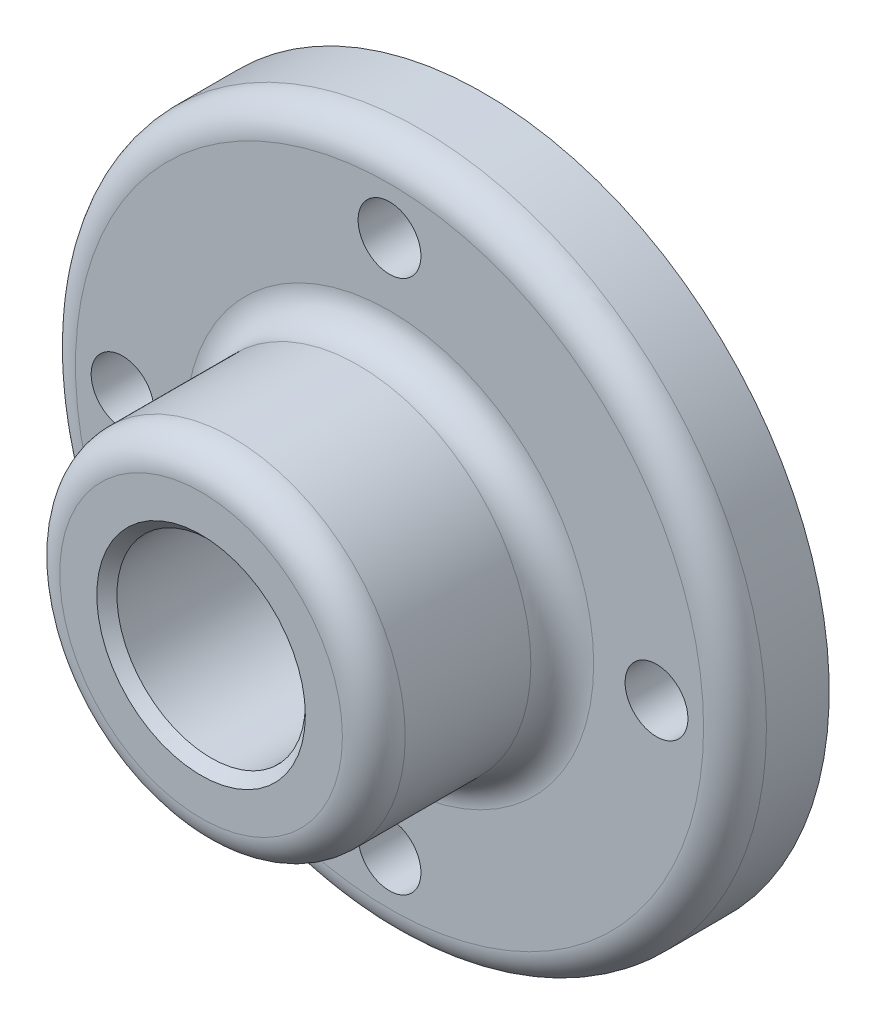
ISO-10303-21;
HEADER;
FILE_DESCRIPTION(('STEP AP214'),'2;1');
FILE_NAME('part.step','',(''),(''),'','','');
FILE_SCHEMA(('AUTOMOTIVE_DESIGN { 1 0 10303 214 1 1 1 1 }'));
ENDSEC;
DATA;
#1=APPLICATION_CONTEXT('core data for automotive mechanical design processes');
#2=APPLICATION_PROTOCOL_DEFINITION('international standard','automotive_design',2000,#1);
#3=PRODUCT_CONTEXT('',#1,'mechanical');
#4=PRODUCT('Part','Part','',(#3));
#5=PRODUCT_RELATED_PRODUCT_CATEGORY('part','',(#4));
#6=PRODUCT_DEFINITION_FORMATION('','',#4);
#7=PRODUCT_DEFINITION_CONTEXT('part definition',#1,'design');
#8=PRODUCT_DEFINITION('design','',#6,#7);
#9=PRODUCT_DEFINITION_SHAPE('','',#8);
#10=(LENGTH_UNIT() NAMED_UNIT(*) SI_UNIT(.MILLI.,.METRE.));
#11=(NAMED_UNIT(*) PLANE_ANGLE_UNIT() SI_UNIT($,.RADIAN.));
#12=(NAMED_UNIT(*) SI_UNIT($,.STERADIAN.) SOLID_ANGLE_UNIT());
#13=UNCERTAINTY_MEASURE_WITH_UNIT(LENGTH_MEASURE(1.E-05),#10,'distance_accuracy_value','');
#14=(GEOMETRIC_REPRESENTATION_CONTEXT(3) GLOBAL_UNCERTAINTY_ASSIGNED_CONTEXT((#13)) GLOBAL_UNIT_ASSIGNED_CONTEXT((#10,
#11,#12)) REPRESENTATION_CONTEXT('',''));
#15=CARTESIAN_POINT('',(0.,0.,0.));
#16=DIRECTION('',(0.,0.,1.));
#17=DIRECTION('',(1.,0.,0.));
#18=AXIS2_PLACEMENT_3D('',#15,#16,#17);
#19=CARTESIAN_POINT('',(0.,0.,19.05));
#20=DIRECTION('',(0.,0.,-1.));
#21=DIRECTION('',(-1.,0.,0.));
#22=AXIS2_PLACEMENT_3D('',#19,#20,#21);
#23=CYLINDRICAL_SURFACE('',#22,69.85);
#24=CARTESIAN_POINT('',(0.,0.,12.7));
#25=DIRECTION('',(0.,0.,1.));
#26=DIRECTION('',(1.,0.,0.));
#27=AXIS2_PLACEMENT_3D('',#24,#25,#26);
#28=CIRCLE('',#27,69.85);
#29=CARTESIAN_POINT('',(-69.85,0.,12.7));
#30=VERTEX_POINT('',#29);
#31=EDGE_CURVE('E40',#30,#30,#28,.F.);
#32=CARTESIAN_POINT('',(0.,0.,0.));
#33=DIRECTION('',(0.,0.,1.));
#34=DIRECTION('',(1.,0.,0.));
#35=AXIS2_PLACEMENT_3D('',#32,#33,#34);
#36=CIRCLE('',#35,69.85);
#37=CARTESIAN_POINT('',(-69.85,0.,0.));
#38=VERTEX_POINT('',#37);
#39=EDGE_CURVE('E61',#38,#38,#36,.T.);
#40=CARTESIAN_POINT('',(-69.85,0.,12.7));
#41=CARTESIAN_POINT('',(-69.85,0.,12.5677083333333));
#42=CARTESIAN_POINT('',(-69.85,0.,12.4354166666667));
#43=CARTESIAN_POINT('',(-69.85,0.,12.1708333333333));
#44=CARTESIAN_POINT('',(-69.85,0.,12.0385416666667));
#45=CARTESIAN_POINT('',(-69.85,0.,11.7739583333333));
#46=CARTESIAN_POINT('',(-69.85,0.,11.6416666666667));
#47=CARTESIAN_POINT('',(-69.85,0.,11.3770833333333));
#48=CARTESIAN_POINT('',(-69.85,0.,11.2447916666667));
#49=CARTESIAN_POINT('',(-69.85,0.,10.9802083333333));
#50=CARTESIAN_POINT('',(-69.85,0.,10.8479166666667));
#51=CARTESIAN_POINT('',(-69.85,0.,10.5833333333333));
#52=CARTESIAN_POINT('',(-69.85,0.,10.4510416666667));
#53=CARTESIAN_POINT('',(-69.85,0.,10.1864583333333));
#54=CARTESIAN_POINT('',(-69.85,0.,10.0541666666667));
#55=CARTESIAN_POINT('',(-69.85,0.,9.78958333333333));
#56=CARTESIAN_POINT('',(-69.85,0.,9.65729166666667));
#57=CARTESIAN_POINT('',(-69.85,0.,9.39270833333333));
#58=CARTESIAN_POINT('',(-69.85,0.,9.26041666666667));
#59=CARTESIAN_POINT('',(-69.85,0.,8.99583333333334));
#60=CARTESIAN_POINT('',(-69.85,0.,8.86354166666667));
#61=CARTESIAN_POINT('',(-69.85,0.,8.59895833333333));
#62=CARTESIAN_POINT('',(-69.85,0.,8.46666666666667));
#63=CARTESIAN_POINT('',(-69.85,0.,8.20208333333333));
#64=CARTESIAN_POINT('',(-69.85,0.,8.06979166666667));
#65=CARTESIAN_POINT('',(-69.85,0.,7.80520833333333));
#66=CARTESIAN_POINT('',(-69.85,0.,7.67291666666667));
#67=CARTESIAN_POINT('',(-69.85,0.,7.40833333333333));
#68=CARTESIAN_POINT('',(-69.85,0.,7.27604166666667));
#69=CARTESIAN_POINT('',(-69.85,0.,7.01145833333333));
#70=CARTESIAN_POINT('',(-69.85,0.,6.87916666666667));
#71=CARTESIAN_POINT('',(-69.85,0.,6.61458333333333));
#72=CARTESIAN_POINT('',(-69.85,0.,6.48229166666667));
#73=CARTESIAN_POINT('',(-69.85,0.,6.21770833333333));
#74=CARTESIAN_POINT('',(-69.85,0.,6.08541666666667));
#75=CARTESIAN_POINT('',(-69.85,0.,5.82083333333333));
#76=CARTESIAN_POINT('',(-69.85,0.,5.68854166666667));
#77=CARTESIAN_POINT('',(-69.85,0.,5.42395833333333));
#78=CARTESIAN_POINT('',(-69.85,0.,5.29166666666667));
#79=CARTESIAN_POINT('',(-69.85,0.,5.02708333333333));
#80=CARTESIAN_POINT('',(-69.85,0.,4.89479166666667));
#81=CARTESIAN_POINT('',(-69.85,0.,4.63020833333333));
#82=CARTESIAN_POINT('',(-69.85,0.,4.49791666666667));
#83=CARTESIAN_POINT('',(-69.85,0.,4.23333333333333));
#84=CARTESIAN_POINT('',(-69.85,0.,4.10104166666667));
#85=CARTESIAN_POINT('',(-69.85,0.,3.83645833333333));
#86=CARTESIAN_POINT('',(-69.85,0.,3.70416666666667));
#87=CARTESIAN_POINT('',(-69.85,0.,3.43958333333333));
#88=CARTESIAN_POINT('',(-69.85,0.,3.30729166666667));
#89=CARTESIAN_POINT('',(-69.85,0.,3.04270833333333));
#90=CARTESIAN_POINT('',(-69.85,0.,2.91041666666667));
#91=CARTESIAN_POINT('',(-69.85,0.,2.64583333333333));
#92=CARTESIAN_POINT('',(-69.85,0.,2.51354166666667));
#93=CARTESIAN_POINT('',(-69.85,0.,2.24895833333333));
#94=CARTESIAN_POINT('',(-69.85,0.,2.11666666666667));
#95=CARTESIAN_POINT('',(-69.85,0.,1.85208333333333));
#96=CARTESIAN_POINT('',(-69.85,0.,1.71979166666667));
#97=CARTESIAN_POINT('',(-69.85,0.,1.45520833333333));
#98=CARTESIAN_POINT('',(-69.85,0.,1.32291666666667));
#99=CARTESIAN_POINT('',(-69.85,0.,1.05833333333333));
#100=CARTESIAN_POINT('',(-69.85,0.,0.926041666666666));
#101=CARTESIAN_POINT('',(-69.85,0.,0.661458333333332));
#102=CARTESIAN_POINT('',(-69.85,0.,0.529166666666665));
#103=CARTESIAN_POINT('',(-69.85,0.,0.264583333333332));
#104=CARTESIAN_POINT('',(-69.85,0.,0.132291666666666));
#105=CARTESIAN_POINT('',(-69.85,0.,0.));
#106=B_SPLINE_CURVE_WITH_KNOTS('',3,(#40,#41,#42,#43,#44,#45,#46,#47,#48,#49,#50,#51,#52,#53,
#54,#55,#56,#57,#58,#59,#60,#61,#62,#63,#64,#65,#66,#67,#68,#69,#70,#71,#72,#73,#74,#75,#76,#77,
#78,#79,#80,#81,#82,#83,#84,#85,#86,#87,#88,#89,#90,#91,#92,#93,#94,#95,#96,#97,#98,#99,#100,
#101,#102,#103,#104,#105),.UNSPECIFIED.,.F.,.F.,(4,2,2,2,2,2,2,2,2,2,2,2,2,2,2,2,2,2,2,2,2,2,2,
2,2,2,2,2,2,2,2,2,4),(0.,0.396874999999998,0.793749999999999,1.190625,1.5875,1.984375,2.38125,
2.778125,3.175,3.571875,3.96875,4.365625,4.7625,5.159375,5.55625,5.953125,6.35,6.746875,7.14375,
7.540625,7.9375,8.334375,8.73125,9.128125,9.525,9.921875,10.31875,10.715625,11.1125,11.509375,
11.90625,12.303125,12.7),.UNSPECIFIED.);
#107=EDGE_CURVE('BSEAM29',#30,#38,#106,.T.);
#108=ORIENTED_EDGE('',*,*,#31,.T.);
#109=ORIENTED_EDGE('',*,*,#39,.T.);
#110=ORIENTED_EDGE('',*,*,#107,.T.);
#111=ORIENTED_EDGE('',*,*,#107,.F.);
#112=EDGE_LOOP('',(#108,#110,#109,#111));
#113=FACE_BOUND('',#112,.T.);
#114=ADVANCED_FACE('F29',(#113),#23,.T.);
#115=CARTESIAN_POINT('',(0.,0.,19.05));
#116=DIRECTION('',(0.,0.,1.));
#117=DIRECTION('',(1.,0.,0.));
#118=AXIS2_PLACEMENT_3D('',#115,#116,#117);
#119=PLANE('',#118);
#120=CARTESIAN_POINT('',(0.,0.,19.05));
#121=DIRECTION('',(0.,0.,1.));
#122=DIRECTION('',(1.,0.,0.));
#123=AXIS2_PLACEMENT_3D('',#120,#121,#122);
#124=CIRCLE('',#123,41.275);
#125=CARTESIAN_POINT('',(41.275,0.,19.05));
#126=VERTEX_POINT('',#125);
#127=EDGE_CURVE('E44',#126,#126,#124,.F.);
#128=ORIENTED_EDGE('',*,*,#127,.T.);
#129=EDGE_LOOP('',(#128));
#130=FACE_BOUND('',#129,.T.);
#131=CARTESIAN_POINT('',(0.,0.,19.05));
#132=DIRECTION('',(0.,0.,1.));
#133=DIRECTION('',(1.,0.,0.));
#134=AXIS2_PLACEMENT_3D('',#131,#132,#133);
#135=CIRCLE('',#134,63.5);
#136=CARTESIAN_POINT('',(63.5,0.,19.05));
#137=VERTEX_POINT('',#136);
#138=EDGE_CURVE('E49',#137,#137,#135,.T.);
#139=ORIENTED_EDGE('',*,*,#138,.T.);
#140=EDGE_LOOP('',(#139));
#141=FACE_BOUND('',#140,.T.);
#142=CARTESIAN_POINT('',(53.975,5.65358443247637E-13,19.05));
#143=DIRECTION('',(0.,0.,1.));
#144=DIRECTION('',(0.,-1.,0.));
#145=AXIS2_PLACEMENT_3D('',#142,#143,#144);
#146=CIRCLE('',#145,6.35);
#147=CARTESIAN_POINT('',(53.9750000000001,-6.34999999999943,19.05));
#148=VERTEX_POINT('',#147);
#149=EDGE_CURVE('E85',#148,#148,#146,.T.);
#150=ORIENTED_EDGE('',*,*,#149,.F.);
#151=EDGE_LOOP('',(#150));
#152=FACE_BOUND('',#151,.T.);
#153=CARTESIAN_POINT('',(3.76905628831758E-13,-53.975,19.05));
#154=DIRECTION('',(0.,0.,1.));
#155=DIRECTION('',(-1.,0.,0.));
#156=AXIS2_PLACEMENT_3D('',#153,#154,#155);
#157=CIRCLE('',#156,6.35);
#158=CARTESIAN_POINT('',(-6.34999999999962,-53.975,19.05));
#159=VERTEX_POINT('',#158);
#160=EDGE_CURVE('E79',#159,#159,#157,.T.);
#161=ORIENTED_EDGE('',*,*,#160,.F.);
#162=EDGE_LOOP('',(#161));
#163=FACE_BOUND('',#162,.T.);
#164=CARTESIAN_POINT('',(-53.975,-1.88452814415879E-13,19.05));
#165=DIRECTION('',(0.,0.,1.));
#166=DIRECTION('',(0.,1.,0.));
#167=AXIS2_PLACEMENT_3D('',#164,#165,#166);
#168=CIRCLE('',#167,6.35);
#169=CARTESIAN_POINT('',(-53.975,6.34999999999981,19.05));
#170=VERTEX_POINT('',#169);
#171=EDGE_CURVE('E71',#170,#170,#168,.T.);
#172=ORIENTED_EDGE('',*,*,#171,.F.);
#173=EDGE_LOOP('',(#172));
#174=FACE_BOUND('',#173,.T.);
#175=CARTESIAN_POINT('',(0.,53.975,19.05));
#176=DIRECTION('',(0.,0.,1.));
#177=DIRECTION('',(1.,0.,0.));
#178=AXIS2_PLACEMENT_3D('',#175,#176,#177);
#179=CIRCLE('',#178,6.35);
#180=CARTESIAN_POINT('',(6.35,53.975,19.05));
#181=VERTEX_POINT('',#180);
#182=EDGE_CURVE('E68',#181,#181,#179,.T.);
#183=ORIENTED_EDGE('',*,*,#182,.F.);
#184=EDGE_LOOP('',(#183));
#185=FACE_BOUND('',#184,.T.);
#186=ADVANCED_FACE('F103',(#130,#141,#152,#163,#174,#185),#119,.T.);
#187=CARTESIAN_POINT('',(0.,0.,0.));
#188=DIRECTION('',(0.,0.,1.));
#189=DIRECTION('',(1.,0.,0.));
#190=AXIS2_PLACEMENT_3D('',#187,#188,#189);
#191=PLANE('',#190);
#192=CARTESIAN_POINT('',(53.975,5.65358443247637E-13,0.));
#193=DIRECTION('',(0.,0.,1.));
#194=DIRECTION('',(0.,-1.,0.));
#195=AXIS2_PLACEMENT_3D('',#192,#193,#194);
#196=CIRCLE('',#195,6.35);
#197=CARTESIAN_POINT('',(53.9750000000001,-6.34999999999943,0.));
#198=VERTEX_POINT('',#197);
#199=EDGE_CURVE('E88',#198,#198,#196,.T.);
#200=ORIENTED_EDGE('',*,*,#199,.T.);
#201=EDGE_LOOP('',(#200));
#202=FACE_BOUND('',#201,.T.);
#203=CARTESIAN_POINT('',(3.76905628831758E-13,-53.975,0.));
#204=DIRECTION('',(0.,0.,1.));
#205=DIRECTION('',(-1.,0.,0.));
#206=AXIS2_PLACEMENT_3D('',#203,#204,#205);
#207=CIRCLE('',#206,6.35);
#208=CARTESIAN_POINT('',(-6.34999999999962,-53.975,0.));
#209=VERTEX_POINT('',#208);
#210=EDGE_CURVE('E82',#209,#209,#207,.T.);
#211=ORIENTED_EDGE('',*,*,#210,.T.);
#212=EDGE_LOOP('',(#211));
#213=FACE_BOUND('',#212,.T.);
#214=CARTESIAN_POINT('',(-53.975,-1.88452814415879E-13,0.));
#215=DIRECTION('',(0.,0.,1.));
#216=DIRECTION('',(0.,1.,0.));
#217=AXIS2_PLACEMENT_3D('',#214,#215,#216);
#218=CIRCLE('',#217,6.35);
#219=CARTESIAN_POINT('',(-53.975,6.34999999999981,0.));
#220=VERTEX_POINT('',#219);
#221=EDGE_CURVE('E76',#220,#220,#218,.T.);
#222=ORIENTED_EDGE('',*,*,#221,.T.);
#223=EDGE_LOOP('',(#222));
#224=FACE_BOUND('',#223,.T.);
#225=CARTESIAN_POINT('',(0.,53.975,0.));
#226=DIRECTION('',(0.,0.,1.));
#227=DIRECTION('',(1.,0.,0.));
#228=AXIS2_PLACEMENT_3D('',#225,#226,#227);
#229=CIRCLE('',#228,6.35);
#230=CARTESIAN_POINT('',(6.35,53.975,0.));
#231=VERTEX_POINT('',#230);
#232=EDGE_CURVE('E67',#231,#231,#229,.T.);
#233=ORIENTED_EDGE('',*,*,#232,.T.);
#234=EDGE_LOOP('',(#233));
#235=FACE_BOUND('',#234,.T.);
#236=CARTESIAN_POINT('',(0.,0.,0.));
#237=DIRECTION('',(0.,0.,1.));
#238=DIRECTION('',(1.,0.,0.));
#239=AXIS2_PLACEMENT_3D('',#236,#237,#238);
#240=CIRCLE('',#239,19.05);
#241=CARTESIAN_POINT('',(19.05,0.,0.));
#242=VERTEX_POINT('',#241);
#243=EDGE_CURVE('E64',#242,#242,#240,.T.);
#244=ORIENTED_EDGE('',*,*,#243,.T.);
#245=EDGE_LOOP('',(#244));
#246=FACE_BOUND('',#245,.T.);
#247=ORIENTED_EDGE('',*,*,#39,.F.);
#248=EDGE_LOOP('',(#247));
#249=FACE_BOUND('',#248,.T.);
#250=ADVANCED_FACE('F92',(#202,#213,#224,#235,#246,#249),#191,.F.);
#251=CARTESIAN_POINT('',(0.,0.,-500000.));
#252=DIRECTION('',(0.,0.,1.));
#253=DIRECTION('',(1.,0.,0.));
#254=AXIS2_PLACEMENT_3D('',#251,#252,#253);
#255=CYLINDRICAL_SURFACE('',#254,34.925);
#256=CARTESIAN_POINT('',(0.,0.,50.7999999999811));
#257=DIRECTION('',(0.,0.,1.));
#258=DIRECTION('',(1.,0.,0.));
#259=AXIS2_PLACEMENT_3D('',#256,#257,#258);
#260=CIRCLE('',#259,34.925);
#261=CARTESIAN_POINT('',(34.925,0.,50.7999999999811));
#262=VERTEX_POINT('',#261);
#263=EDGE_CURVE('E52',#262,#262,#260,.F.);
#264=CARTESIAN_POINT('',(0.,0.,25.3999999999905));
#265=DIRECTION('',(0.,0.,1.));
#266=DIRECTION('',(1.,0.,0.));
#267=AXIS2_PLACEMENT_3D('',#264,#265,#266);
#268=CIRCLE('',#267,34.925);
#269=CARTESIAN_POINT('',(34.925,0.,25.3999999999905));
#270=VERTEX_POINT('',#269);
#271=EDGE_CURVE('E55',#270,#270,#268,.T.);
#272=CARTESIAN_POINT('',(34.925,0.,50.7999999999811));
#273=CARTESIAN_POINT('',(34.925,0.,50.5354166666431));
#274=CARTESIAN_POINT('',(34.925,0.,50.2708333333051));
#275=CARTESIAN_POINT('',(34.925,0.,49.7416666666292));
#276=CARTESIAN_POINT('',(34.925,0.,49.4770833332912));
#277=CARTESIAN_POINT('',(34.925,0.,48.9479166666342));
#278=CARTESIAN_POINT('',(34.925,0.,48.6833333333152));
#279=CARTESIAN_POINT('',(34.925,0.,48.1541666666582));
#280=CARTESIAN_POINT('',(34.925,0.,47.8895833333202));
#281=CARTESIAN_POINT('',(34.925,0.,47.3604166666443));
#282=CARTESIAN_POINT('',(34.925,0.,47.0958333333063));
#283=CARTESIAN_POINT('',(34.925,0.,46.5666666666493));
#284=CARTESIAN_POINT('',(34.925,0.,46.3020833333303));
#285=CARTESIAN_POINT('',(34.925,0.,45.7729166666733));
#286=CARTESIAN_POINT('',(34.925,0.,45.5083333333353));
#287=CARTESIAN_POINT('',(34.925,0.,44.9791666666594));
#288=CARTESIAN_POINT('',(34.925,0.,44.7145833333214));
#289=CARTESIAN_POINT('',(34.925,0.,44.1854166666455));
#290=CARTESIAN_POINT('',(34.925,0.,43.9208333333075));
#291=CARTESIAN_POINT('',(34.925,0.,43.3916666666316));
#292=CARTESIAN_POINT('',(34.925,0.,43.1270833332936));
#293=CARTESIAN_POINT('',(34.925,0.,42.5979166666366));
#294=CARTESIAN_POINT('',(34.925,0.,42.3333333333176));
#295=CARTESIAN_POINT('',(34.925,0.,41.8041666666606));
#296=CARTESIAN_POINT('',(34.925,0.,41.5395833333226));
#297=CARTESIAN_POINT('',(34.925,0.,41.0104166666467));
#298=CARTESIAN_POINT('',(34.925,0.,40.7458333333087));
#299=CARTESIAN_POINT('',(34.925,0.,40.2166666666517));
#300=CARTESIAN_POINT('',(34.925,0.,39.9520833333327));
#301=CARTESIAN_POINT('',(34.925,0.,39.4229166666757));
#302=CARTESIAN_POINT('',(34.925,0.,39.1583333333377));
#303=CARTESIAN_POINT('',(34.925,0.,38.6291666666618));
#304=CARTESIAN_POINT('',(34.925,0.,38.3645833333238));
#305=CARTESIAN_POINT('',(34.925,0.,37.8354166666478));
#306=CARTESIAN_POINT('',(34.925,0.,37.5708333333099));
#307=CARTESIAN_POINT('',(34.925,0.,37.0416666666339));
#308=CARTESIAN_POINT('',(34.925,0.,36.777083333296));
#309=CARTESIAN_POINT('',(34.925,0.,36.247916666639));
#310=CARTESIAN_POINT('',(34.925,0.,35.9833333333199));
#311=CARTESIAN_POINT('',(34.925,0.,35.4541666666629));
#312=CARTESIAN_POINT('',(34.925,0.,35.189583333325));
#313=CARTESIAN_POINT('',(34.925,0.,34.660416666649));
#314=CARTESIAN_POINT('',(34.925,0.,34.3958333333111));
#315=CARTESIAN_POINT('',(34.925,0.,33.8666666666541));
#316=CARTESIAN_POINT('',(34.925,0.,33.602083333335));
#317=CARTESIAN_POINT('',(34.925,0.,33.072916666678));
#318=CARTESIAN_POINT('',(34.925,0.,32.8083333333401));
#319=CARTESIAN_POINT('',(34.925,0.,32.2791666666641));
#320=CARTESIAN_POINT('',(34.925,0.,32.0145833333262));
#321=CARTESIAN_POINT('',(34.925,0.,31.4854166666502));
#322=CARTESIAN_POINT('',(34.925,0.,31.2208333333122));
#323=CARTESIAN_POINT('',(34.925,0.,30.6916666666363));
#324=CARTESIAN_POINT('',(34.925,0.,30.4270833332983));
#325=CARTESIAN_POINT('',(34.925,0.,29.8979166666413));
#326=CARTESIAN_POINT('',(34.925,0.,29.6333333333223));
#327=CARTESIAN_POINT('',(34.925,0.,29.1041666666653));
#328=CARTESIAN_POINT('',(34.925,0.,28.8395833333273));
#329=CARTESIAN_POINT('',(34.925,0.,28.3104166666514));
#330=CARTESIAN_POINT('',(34.925,0.,28.0458333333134));
#331=CARTESIAN_POINT('',(34.925,0.,27.5166666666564));
#332=CARTESIAN_POINT('',(34.925,0.,27.2520833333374));
#333=CARTESIAN_POINT('',(34.925,0.,26.7229166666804));
#334=CARTESIAN_POINT('',(34.925,0.,26.4583333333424));
#335=CARTESIAN_POINT('',(34.925,0.,25.9291666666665));
#336=CARTESIAN_POINT('',(34.925,0.,25.6645833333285));
#337=CARTESIAN_POINT('',(34.925,0.,25.3999999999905));
#338=B_SPLINE_CURVE_WITH_KNOTS('',3,(#272,#273,#274,#275,#276,#277,#278,#279,#280,#281,#282,
#283,#284,#285,#286,#287,#288,#289,#290,#291,#292,#293,#294,#295,#296,#297,#298,#299,#300,#301,
#302,#303,#304,#305,#306,#307,#308,#309,#310,#311,#312,#313,#314,#315,#316,#317,#318,#319,#320,
#321,#322,#323,#324,#325,#326,#327,#328,#329,#330,#331,#332,#333,#334,#335,#336,#337),
.UNSPECIFIED.,.F.,.F.,(4,2,2,2,2,2,2,2,2,2,2,2,2,2,2,2,2,2,2,2,2,2,2,2,2,2,2,2,2,2,2,2,4),(0.,
0.793750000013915,1.58750000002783,2.3812499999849,3.17499999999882,3.96875000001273,
4.7624999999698,5.55624999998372,6.34999999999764,7.14375000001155,7.93750000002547,
8.73124999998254,9.52499999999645,10.3187500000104,11.1124999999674,11.9062499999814,
12.6999999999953,13.4937500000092,14.2875000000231,15.0812499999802,15.8749999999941,
16.668750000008,17.4624999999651,18.256249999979,19.0499999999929,19.8437500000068,
20.6375000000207,21.4312499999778,22.2249999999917,23.0187500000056,23.8124999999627,
24.6062499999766,25.3999999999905),.UNSPECIFIED.);
#339=EDGE_CURVE('BSEAM128',#262,#270,#338,.T.);
#340=ORIENTED_EDGE('',*,*,#263,.T.);
#341=ORIENTED_EDGE('',*,*,#271,.T.);
#342=ORIENTED_EDGE('',*,*,#339,.T.);
#343=ORIENTED_EDGE('',*,*,#339,.F.);
#344=EDGE_LOOP('',(#340,#342,#341,#343));
#345=FACE_BOUND('',#344,.T.);
#346=ADVANCED_FACE('F128',(#345),#255,.T.);
#347=CARTESIAN_POINT('',(0.,0.,57.15));
#348=DIRECTION('',(0.,0.,1.));
#349=DIRECTION('',(1.,0.,0.));
#350=AXIS2_PLACEMENT_3D('',#347,#348,#349);
#351=PLANE('',#350);
#352=CARTESIAN_POINT('',(0.,0.,57.15));
#353=DIRECTION('',(0.,0.,1.));
#354=DIRECTION('',(1.,0.,0.));
#355=AXIS2_PLACEMENT_3D('',#352,#353,#354);
#356=CIRCLE('',#355,21.082);
#357=CARTESIAN_POINT('',(21.082,0.,57.15));
#358=VERTEX_POINT('',#357);
#359=EDGE_CURVE('E10',#358,#358,#356,.F.);
#360=ORIENTED_EDGE('',*,*,#359,.T.);
#361=EDGE_LOOP('',(#360));
#362=FACE_BOUND('',#361,.T.);
#363=CARTESIAN_POINT('',(0.,0.,57.15));
#364=DIRECTION('',(0.,0.,1.));
#365=DIRECTION('',(1.,0.,0.));
#366=AXIS2_PLACEMENT_3D('',#363,#364,#365);
#367=CIRCLE('',#366,28.575);
#368=CARTESIAN_POINT('',(28.575,0.,57.15));
#369=VERTEX_POINT('',#368);
#370=EDGE_CURVE('E58',#369,#369,#367,.T.);
#371=ORIENTED_EDGE('',*,*,#370,.T.);
#372=EDGE_LOOP('',(#371));
#373=FACE_BOUND('',#372,.T.);
#374=ADVANCED_FACE('F126',(#362,#373),#351,.T.);
#375=CARTESIAN_POINT('',(0.,0.,0.));
#376=DIRECTION('',(0.,0.,1.));
#377=DIRECTION('',(1.,0.,0.));
#378=AXIS2_PLACEMENT_3D('',#375,#376,#377);
#379=CYLINDRICAL_SURFACE('',#378,19.05);
#380=CARTESIAN_POINT('',(0.,0.,55.118));
#381=DIRECTION('',(0.,0.,1.));
#382=DIRECTION('',(1.,0.,0.));
#383=AXIS2_PLACEMENT_3D('',#380,#381,#382);
#384=CIRCLE('',#383,19.05);
#385=CARTESIAN_POINT('',(19.05,0.,55.118));
#386=VERTEX_POINT('',#385);
#387=EDGE_CURVE('E36',#386,#386,#384,.T.);
#388=ORIENTED_EDGE('',*,*,#387,.T.);
#389=EDGE_LOOP('',(#388));
#390=FACE_BOUND('',#389,.T.);
#391=ORIENTED_EDGE('',*,*,#243,.F.);
#392=EDGE_LOOP('',(#391));
#393=FACE_BOUND('',#392,.T.);
#394=ADVANCED_FACE('F117',(#390,#393),#379,.F.);
#395=CARTESIAN_POINT('',(0.,53.975,0.));
#396=DIRECTION('',(0.,0.,1.));
#397=DIRECTION('',(1.,0.,0.));
#398=AXIS2_PLACEMENT_3D('',#395,#396,#397);
#399=CYLINDRICAL_SURFACE('',#398,6.35);
#400=CARTESIAN_POINT('',(6.35,53.975,0.));
#401=CARTESIAN_POINT('',(6.35,53.975,0.1984375));
#402=CARTESIAN_POINT('',(6.35,53.975,0.396875));
#403=CARTESIAN_POINT('',(6.35,53.975,0.79375));
#404=CARTESIAN_POINT('',(6.35,53.975,0.9921875));
#405=CARTESIAN_POINT('',(6.35,53.975,1.3890625));
#406=CARTESIAN_POINT('',(6.35,53.975,1.5875));
#407=CARTESIAN_POINT('',(6.35,53.975,1.984375));
#408=CARTESIAN_POINT('',(6.35,53.975,2.1828125));
#409=CARTESIAN_POINT('',(6.35,53.975,2.5796875));
#410=CARTESIAN_POINT('',(6.35,53.975,2.778125));
#411=CARTESIAN_POINT('',(6.35,53.975,3.175));
#412=CARTESIAN_POINT('',(6.35,53.975,3.3734375));
#413=CARTESIAN_POINT('',(6.35,53.975,3.7703125));
#414=CARTESIAN_POINT('',(6.35,53.975,3.96875));
#415=CARTESIAN_POINT('',(6.35,53.975,4.365625));
#416=CARTESIAN_POINT('',(6.35,53.975,4.5640625));
#417=CARTESIAN_POINT('',(6.35,53.975,4.9609375));
#418=CARTESIAN_POINT('',(6.35,53.975,5.159375));
#419=CARTESIAN_POINT('',(6.35,53.975,5.55625));
#420=CARTESIAN_POINT('',(6.35,53.975,5.7546875));
#421=CARTESIAN_POINT('',(6.35,53.975,6.1515625));
#422=CARTESIAN_POINT('',(6.35,53.975,6.35));
#423=CARTESIAN_POINT('',(6.35,53.975,6.746875));
#424=CARTESIAN_POINT('',(6.35,53.975,6.9453125));
#425=CARTESIAN_POINT('',(6.35,53.975,7.3421875));
#426=CARTESIAN_POINT('',(6.35,53.975,7.540625));
#427=CARTESIAN_POINT('',(6.35,53.975,7.9375));
#428=CARTESIAN_POINT('',(6.35,53.975,8.1359375));
#429=CARTESIAN_POINT('',(6.35,53.975,8.5328125));
#430=CARTESIAN_POINT('',(6.35,53.975,8.73125));
#431=CARTESIAN_POINT('',(6.35,53.975,9.128125));
#432=CARTESIAN_POINT('',(6.35,53.975,9.3265625));
#433=CARTESIAN_POINT('',(6.35,53.975,9.7234375));
#434=CARTESIAN_POINT('',(6.35,53.975,9.921875));
#435=CARTESIAN_POINT('',(6.35,53.975,10.31875));
#436=CARTESIAN_POINT('',(6.35,53.975,10.5171875));
#437=CARTESIAN_POINT('',(6.35,53.975,10.9140625));
#438=CARTESIAN_POINT('',(6.35,53.975,11.1125));
#439=CARTESIAN_POINT('',(6.35,53.975,11.509375));
#440=CARTESIAN_POINT('',(6.35,53.975,11.7078125));
#441=CARTESIAN_POINT('',(6.35,53.975,12.1046875));
#442=CARTESIAN_POINT('',(6.35,53.975,12.303125));
#443=CARTESIAN_POINT('',(6.35,53.975,12.7));
#444=CARTESIAN_POINT('',(6.35,53.975,12.8984375));
#445=CARTESIAN_POINT('',(6.35,53.975,13.2953125));
#446=CARTESIAN_POINT('',(6.35,53.975,13.49375));
#447=CARTESIAN_POINT('',(6.35,53.975,13.890625));
#448=CARTESIAN_POINT('',(6.35,53.975,14.0890625));
#449=CARTESIAN_POINT('',(6.35,53.975,14.4859375));
#450=CARTESIAN_POINT('',(6.35,53.975,14.684375));
#451=CARTESIAN_POINT('',(6.35,53.975,15.08125));
#452=CARTESIAN_POINT('',(6.35,53.975,15.2796875));
#453=CARTESIAN_POINT('',(6.35,53.975,15.6765625));
#454=CARTESIAN_POINT('',(6.35,53.975,15.875));
#455=CARTESIAN_POINT('',(6.35,53.975,16.271875));
#456=CARTESIAN_POINT('',(6.35,53.975,16.4703125));
#457=CARTESIAN_POINT('',(6.35,53.975,16.8671875));
#458=CARTESIAN_POINT('',(6.35,53.975,17.065625));
#459=CARTESIAN_POINT('',(6.35,53.975,17.4625));
#460=CARTESIAN_POINT('',(6.35,53.975,17.6609375));
#461=CARTESIAN_POINT('',(6.35,53.975,18.0578125));
#462=CARTESIAN_POINT('',(6.35,53.975,18.25625));
#463=CARTESIAN_POINT('',(6.35,53.975,18.653125));
#464=CARTESIAN_POINT('',(6.35,53.975,18.8515625));
#465=CARTESIAN_POINT('',(6.35,53.975,19.05));
#466=B_SPLINE_CURVE_WITH_KNOTS('',3,(#400,#401,#402,#403,#404,#405,#406,#407,#408,#409,#410,
#411,#412,#413,#414,#415,#416,#417,#418,#419,#420,#421,#422,#423,#424,#425,#426,#427,#428,#429,
#430,#431,#432,#433,#434,#435,#436,#437,#438,#439,#440,#441,#442,#443,#444,#445,#446,#447,#448,
#449,#450,#451,#452,#453,#454,#455,#456,#457,#458,#459,#460,#461,#462,#463,#464,#465),
.UNSPECIFIED.,.F.,.F.,(4,2,2,2,2,2,2,2,2,2,2,2,2,2,2,2,2,2,2,2,2,2,2,2,2,2,2,2,2,2,2,2,4),(0.,
0.5953125,1.190625,1.7859375,2.38125,2.9765625,3.571875,4.1671875,4.7625,5.3578125,5.953125,
6.5484375,7.14375,7.7390625,8.334375,8.9296875,9.525,10.1203125,10.715625,11.3109375,11.90625,
12.5015625,13.096875,13.6921875,14.2875,14.8828125,15.478125,16.0734375,16.66875,17.2640625,
17.859375,18.4546875,19.05),.UNSPECIFIED.);
#467=EDGE_CURVE('BSEAM114',#231,#181,#466,.T.);
#468=ORIENTED_EDGE('',*,*,#232,.F.);
#469=ORIENTED_EDGE('',*,*,#182,.T.);
#470=ORIENTED_EDGE('',*,*,#467,.T.);
#471=ORIENTED_EDGE('',*,*,#467,.F.);
#472=EDGE_LOOP('',(#468,#470,#469,#471));
#473=FACE_BOUND('',#472,.T.);
#474=ADVANCED_FACE('F114',(#473),#399,.F.);
#475=CARTESIAN_POINT('',(-53.975,-1.88452814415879E-13,0.));
#476=DIRECTION('',(0.,0.,1.));
#477=DIRECTION('',(0.,1.,0.));
#478=AXIS2_PLACEMENT_3D('',#475,#476,#477);
#479=CYLINDRICAL_SURFACE('',#478,6.35);
#480=CARTESIAN_POINT('',(-53.975,6.34999999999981,0.));
#481=CARTESIAN_POINT('',(-53.975,6.34999999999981,0.1984375));
#482=CARTESIAN_POINT('',(-53.975,6.34999999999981,0.396875));
#483=CARTESIAN_POINT('',(-53.975,6.34999999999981,0.79375));
#484=CARTESIAN_POINT('',(-53.975,6.34999999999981,0.9921875));
#485=CARTESIAN_POINT('',(-53.975,6.34999999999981,1.3890625));
#486=CARTESIAN_POINT('',(-53.975,6.34999999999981,1.5875));
#487=CARTESIAN_POINT('',(-53.975,6.34999999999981,1.984375));
#488=CARTESIAN_POINT('',(-53.975,6.34999999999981,2.1828125));
#489=CARTESIAN_POINT('',(-53.975,6.34999999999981,2.5796875));
#490=CARTESIAN_POINT('',(-53.975,6.34999999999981,2.778125));
#491=CARTESIAN_POINT('',(-53.975,6.34999999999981,3.175));
#492=CARTESIAN_POINT('',(-53.975,6.34999999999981,3.3734375));
#493=CARTESIAN_POINT('',(-53.975,6.34999999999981,3.7703125));
#494=CARTESIAN_POINT('',(-53.975,6.34999999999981,3.96875));
#495=CARTESIAN_POINT('',(-53.975,6.34999999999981,4.365625));
#496=CARTESIAN_POINT('',(-53.975,6.34999999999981,4.5640625));
#497=CARTESIAN_POINT('',(-53.975,6.34999999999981,4.9609375));
#498=CARTESIAN_POINT('',(-53.975,6.34999999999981,5.159375));
#499=CARTESIAN_POINT('',(-53.975,6.34999999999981,5.55625));
#500=CARTESIAN_POINT('',(-53.975,6.34999999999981,5.7546875));
#501=CARTESIAN_POINT('',(-53.975,6.34999999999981,6.1515625));
#502=CARTESIAN_POINT('',(-53.975,6.34999999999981,6.35));
#503=CARTESIAN_POINT('',(-53.975,6.34999999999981,6.746875));
#504=CARTESIAN_POINT('',(-53.975,6.34999999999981,6.9453125));
#505=CARTESIAN_POINT('',(-53.975,6.34999999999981,7.3421875));
#506=CARTESIAN_POINT('',(-53.975,6.34999999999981,7.540625));
#507=CARTESIAN_POINT('',(-53.975,6.34999999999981,7.9375));
#508=CARTESIAN_POINT('',(-53.975,6.34999999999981,8.1359375));
#509=CARTESIAN_POINT('',(-53.975,6.34999999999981,8.5328125));
#510=CARTESIAN_POINT('',(-53.975,6.34999999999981,8.73125));
#511=CARTESIAN_POINT('',(-53.975,6.34999999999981,9.128125));
#512=CARTESIAN_POINT('',(-53.975,6.34999999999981,9.3265625));
#513=CARTESIAN_POINT('',(-53.975,6.34999999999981,9.7234375));
#514=CARTESIAN_POINT('',(-53.975,6.34999999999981,9.921875));
#515=CARTESIAN_POINT('',(-53.975,6.34999999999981,10.31875));
#516=CARTESIAN_POINT('',(-53.975,6.34999999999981,10.5171875));
#517=CARTESIAN_POINT('',(-53.975,6.34999999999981,10.9140625));
#518=CARTESIAN_POINT('',(-53.975,6.34999999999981,11.1125));
#519=CARTESIAN_POINT('',(-53.975,6.34999999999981,11.509375));
#520=CARTESIAN_POINT('',(-53.975,6.34999999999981,11.7078125));
#521=CARTESIAN_POINT('',(-53.975,6.34999999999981,12.1046875));
#522=CARTESIAN_POINT('',(-53.975,6.34999999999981,12.303125));
#523=CARTESIAN_POINT('',(-53.975,6.34999999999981,12.7));
#524=CARTESIAN_POINT('',(-53.975,6.34999999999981,12.8984375));
#525=CARTESIAN_POINT('',(-53.975,6.34999999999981,13.2953125));
#526=CARTESIAN_POINT('',(-53.975,6.34999999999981,13.49375));
#527=CARTESIAN_POINT('',(-53.975,6.34999999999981,13.890625));
#528=CARTESIAN_POINT('',(-53.975,6.34999999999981,14.0890625));
#529=CARTESIAN_POINT('',(-53.975,6.34999999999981,14.4859375));
#530=CARTESIAN_POINT('',(-53.975,6.34999999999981,14.684375));
#531=CARTESIAN_POINT('',(-53.975,6.34999999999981,15.08125));
#532=CARTESIAN_POINT('',(-53.975,6.34999999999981,15.2796875));
#533=CARTESIAN_POINT('',(-53.975,6.34999999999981,15.6765625));
#534=CARTESIAN_POINT('',(-53.975,6.34999999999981,15.875));
#535=CARTESIAN_POINT('',(-53.975,6.34999999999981,16.271875));
#536=CARTESIAN_POINT('',(-53.975,6.34999999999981,16.4703125));
#537=CARTESIAN_POINT('',(-53.975,6.34999999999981,16.8671875));
#538=CARTESIAN_POINT('',(-53.975,6.34999999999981,17.065625));
#539=CARTESIAN_POINT('',(-53.975,6.34999999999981,17.4625));
#540=CARTESIAN_POINT('',(-53.975,6.34999999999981,17.6609375));
#541=CARTESIAN_POINT('',(-53.975,6.34999999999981,18.0578125));
#542=CARTESIAN_POINT('',(-53.975,6.34999999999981,18.25625));
#543=CARTESIAN_POINT('',(-53.975,6.34999999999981,18.653125));
#544=CARTESIAN_POINT('',(-53.975,6.34999999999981,18.8515625));
#545=CARTESIAN_POINT('',(-53.975,6.34999999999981,19.05));
#546=B_SPLINE_CURVE_WITH_KNOTS('',3,(#480,#481,#482,#483,#484,#485,#486,#487,#488,#489,#490,
#491,#492,#493,#494,#495,#496,#497,#498,#499,#500,#501,#502,#503,#504,#505,#506,#507,#508,#509,
#510,#511,#512,#513,#514,#515,#516,#517,#518,#519,#520,#521,#522,#523,#524,#525,#526,#527,#528,
#529,#530,#531,#532,#533,#534,#535,#536,#537,#538,#539,#540,#541,#542,#543,#544,#545),
.UNSPECIFIED.,.F.,.F.,(4,2,2,2,2,2,2,2,2,2,2,2,2,2,2,2,2,2,2,2,2,2,2,2,2,2,2,2,2,2,2,2,4),(0.,
0.5953125,1.190625,1.7859375,2.38125,2.9765625,3.571875,4.1671875,4.7625,5.3578125,5.953125,
6.5484375,7.14375,7.7390625,8.334375,8.9296875,9.525,10.1203125,10.715625,11.3109375,11.90625,
12.5015625,13.096875,13.6921875,14.2875,14.8828125,15.478125,16.0734375,16.66875,17.2640625,
17.859375,18.4546875,19.05),.UNSPECIFIED.);
#547=EDGE_CURVE('BSEAM116',#220,#170,#546,.T.);
#548=ORIENTED_EDGE('',*,*,#221,.F.);
#549=ORIENTED_EDGE('',*,*,#171,.T.);
#550=ORIENTED_EDGE('',*,*,#547,.T.);
#551=ORIENTED_EDGE('',*,*,#547,.F.);
#552=EDGE_LOOP('',(#548,#550,#549,#551));
#553=FACE_BOUND('',#552,.T.);
#554=ADVANCED_FACE('F116',(#553),#479,.F.);
#555=CARTESIAN_POINT('',(3.76905628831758E-13,-53.975,0.));
#556=DIRECTION('',(0.,0.,1.));
#557=DIRECTION('',(-1.,0.,0.));
#558=AXIS2_PLACEMENT_3D('',#555,#556,#557);
#559=CYLINDRICAL_SURFACE('',#558,6.35);
#560=CARTESIAN_POINT('',(-6.34999999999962,-53.975,0.));
#561=CARTESIAN_POINT('',(-6.34999999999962,-53.975,0.1984375));
#562=CARTESIAN_POINT('',(-6.34999999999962,-53.975,0.396875));
#563=CARTESIAN_POINT('',(-6.34999999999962,-53.975,0.79375));
#564=CARTESIAN_POINT('',(-6.34999999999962,-53.975,0.9921875));
#565=CARTESIAN_POINT('',(-6.34999999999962,-53.975,1.3890625));
#566=CARTESIAN_POINT('',(-6.34999999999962,-53.975,1.5875));
#567=CARTESIAN_POINT('',(-6.34999999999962,-53.975,1.984375));
#568=CARTESIAN_POINT('',(-6.34999999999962,-53.975,2.1828125));
#569=CARTESIAN_POINT('',(-6.34999999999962,-53.975,2.5796875));
#570=CARTESIAN_POINT('',(-6.34999999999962,-53.975,2.778125));
#571=CARTESIAN_POINT('',(-6.34999999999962,-53.975,3.175));
#572=CARTESIAN_POINT('',(-6.34999999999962,-53.975,3.3734375));
#573=CARTESIAN_POINT('',(-6.34999999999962,-53.975,3.7703125));
#574=CARTESIAN_POINT('',(-6.34999999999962,-53.975,3.96875));
#575=CARTESIAN_POINT('',(-6.34999999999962,-53.975,4.365625));
#576=CARTESIAN_POINT('',(-6.34999999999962,-53.975,4.5640625));
#577=CARTESIAN_POINT('',(-6.34999999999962,-53.975,4.9609375));
#578=CARTESIAN_POINT('',(-6.34999999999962,-53.975,5.159375));
#579=CARTESIAN_POINT('',(-6.34999999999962,-53.975,5.55625));
#580=CARTESIAN_POINT('',(-6.34999999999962,-53.975,5.7546875));
#581=CARTESIAN_POINT('',(-6.34999999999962,-53.975,6.1515625));
#582=CARTESIAN_POINT('',(-6.34999999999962,-53.975,6.35));
#583=CARTESIAN_POINT('',(-6.34999999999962,-53.975,6.746875));
#584=CARTESIAN_POINT('',(-6.34999999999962,-53.975,6.9453125));
#585=CARTESIAN_POINT('',(-6.34999999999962,-53.975,7.3421875));
#586=CARTESIAN_POINT('',(-6.34999999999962,-53.975,7.540625));
#587=CARTESIAN_POINT('',(-6.34999999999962,-53.975,7.9375));
#588=CARTESIAN_POINT('',(-6.34999999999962,-53.975,8.1359375));
#589=CARTESIAN_POINT('',(-6.34999999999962,-53.975,8.5328125));
#590=CARTESIAN_POINT('',(-6.34999999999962,-53.975,8.73125));
#591=CARTESIAN_POINT('',(-6.34999999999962,-53.975,9.128125));
#592=CARTESIAN_POINT('',(-6.34999999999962,-53.975,9.3265625));
#593=CARTESIAN_POINT('',(-6.34999999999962,-53.975,9.7234375));
#594=CARTESIAN_POINT('',(-6.34999999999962,-53.975,9.921875));
#595=CARTESIAN_POINT('',(-6.34999999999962,-53.975,10.31875));
#596=CARTESIAN_POINT('',(-6.34999999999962,-53.975,10.5171875));
#597=CARTESIAN_POINT('',(-6.34999999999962,-53.975,10.9140625));
#598=CARTESIAN_POINT('',(-6.34999999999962,-53.975,11.1125));
#599=CARTESIAN_POINT('',(-6.34999999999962,-53.975,11.509375));
#600=CARTESIAN_POINT('',(-6.34999999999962,-53.975,11.7078125));
#601=CARTESIAN_POINT('',(-6.34999999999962,-53.975,12.1046875));
#602=CARTESIAN_POINT('',(-6.34999999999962,-53.975,12.303125));
#603=CARTESIAN_POINT('',(-6.34999999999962,-53.975,12.7));
#604=CARTESIAN_POINT('',(-6.34999999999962,-53.975,12.8984375));
#605=CARTESIAN_POINT('',(-6.34999999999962,-53.975,13.2953125));
#606=CARTESIAN_POINT('',(-6.34999999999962,-53.975,13.49375));
#607=CARTESIAN_POINT('',(-6.34999999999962,-53.975,13.890625));
#608=CARTESIAN_POINT('',(-6.34999999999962,-53.975,14.0890625));
#609=CARTESIAN_POINT('',(-6.34999999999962,-53.975,14.4859375));
#610=CARTESIAN_POINT('',(-6.34999999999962,-53.975,14.684375));
#611=CARTESIAN_POINT('',(-6.34999999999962,-53.975,15.08125));
#612=CARTESIAN_POINT('',(-6.34999999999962,-53.975,15.2796875));
#613=CARTESIAN_POINT('',(-6.34999999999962,-53.975,15.6765625));
#614=CARTESIAN_POINT('',(-6.34999999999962,-53.975,15.875));
#615=CARTESIAN_POINT('',(-6.34999999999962,-53.975,16.271875));
#616=CARTESIAN_POINT('',(-6.34999999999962,-53.975,16.4703125));
#617=CARTESIAN_POINT('',(-6.34999999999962,-53.975,16.8671875));
#618=CARTESIAN_POINT('',(-6.34999999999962,-53.975,17.065625));
#619=CARTESIAN_POINT('',(-6.34999999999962,-53.975,17.4625));
#620=CARTESIAN_POINT('',(-6.34999999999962,-53.975,17.6609375));
#621=CARTESIAN_POINT('',(-6.34999999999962,-53.975,18.0578125));
#622=CARTESIAN_POINT('',(-6.34999999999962,-53.975,18.25625));
#623=CARTESIAN_POINT('',(-6.34999999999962,-53.975,18.653125));
#624=CARTESIAN_POINT('',(-6.34999999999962,-53.975,18.8515625));
#625=CARTESIAN_POINT('',(-6.34999999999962,-53.975,19.05));
#626=B_SPLINE_CURVE_WITH_KNOTS('',3,(#560,#561,#562,#563,#564,#565,#566,#567,#568,#569,#570,
#571,#572,#573,#574,#575,#576,#577,#578,#579,#580,#581,#582,#583,#584,#585,#586,#587,#588,#589,
#590,#591,#592,#593,#594,#595,#596,#597,#598,#599,#600,#601,#602,#603,#604,#605,#606,#607,#608,
#609,#610,#611,#612,#613,#614,#615,#616,#617,#618,#619,#620,#621,#622,#623,#624,#625),
.UNSPECIFIED.,.F.,.F.,(4,2,2,2,2,2,2,2,2,2,2,2,2,2,2,2,2,2,2,2,2,2,2,2,2,2,2,2,2,2,2,2,4),(0.,
0.5953125,1.190625,1.7859375,2.38125,2.9765625,3.571875,4.1671875,4.7625,5.3578125,5.953125,
6.5484375,7.14375,7.7390625,8.334375,8.9296875,9.525,10.1203125,10.715625,11.3109375,11.90625,
12.5015625,13.096875,13.6921875,14.2875,14.8828125,15.478125,16.0734375,16.66875,17.2640625,
17.859375,18.4546875,19.05),.UNSPECIFIED.);
#627=EDGE_CURVE('BSEAM99',#209,#159,#626,.T.);
#628=ORIENTED_EDGE('',*,*,#210,.F.);
#629=ORIENTED_EDGE('',*,*,#160,.T.);
#630=ORIENTED_EDGE('',*,*,#627,.T.);
#631=ORIENTED_EDGE('',*,*,#627,.F.);
#632=EDGE_LOOP('',(#628,#630,#629,#631));
#633=FACE_BOUND('',#632,.T.);
#634=ADVANCED_FACE('F99',(#633),#559,.F.);
#635=CARTESIAN_POINT('',(53.975,5.65358443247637E-13,0.));
#636=DIRECTION('',(0.,0.,1.));
#637=DIRECTION('',(0.,-1.,0.));
#638=AXIS2_PLACEMENT_3D('',#635,#636,#637);
#639=CYLINDRICAL_SURFACE('',#638,6.35);
#640=CARTESIAN_POINT('',(53.9750000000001,-6.34999999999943,0.));
#641=CARTESIAN_POINT('',(53.9750000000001,-6.34999999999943,0.1984375));
#642=CARTESIAN_POINT('',(53.9750000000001,-6.34999999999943,0.396875));
#643=CARTESIAN_POINT('',(53.9750000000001,-6.34999999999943,0.79375));
#644=CARTESIAN_POINT('',(53.9750000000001,-6.34999999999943,0.9921875));
#645=CARTESIAN_POINT('',(53.9750000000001,-6.34999999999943,1.3890625));
#646=CARTESIAN_POINT('',(53.9750000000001,-6.34999999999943,1.5875));
#647=CARTESIAN_POINT('',(53.9750000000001,-6.34999999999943,1.984375));
#648=CARTESIAN_POINT('',(53.9750000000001,-6.34999999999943,2.1828125));
#649=CARTESIAN_POINT('',(53.9750000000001,-6.34999999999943,2.5796875));
#650=CARTESIAN_POINT('',(53.9750000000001,-6.34999999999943,2.778125));
#651=CARTESIAN_POINT('',(53.9750000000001,-6.34999999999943,3.175));
#652=CARTESIAN_POINT('',(53.9750000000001,-6.34999999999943,3.3734375));
#653=CARTESIAN_POINT('',(53.9750000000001,-6.34999999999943,3.7703125));
#654=CARTESIAN_POINT('',(53.9750000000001,-6.34999999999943,3.96875));
#655=CARTESIAN_POINT('',(53.9750000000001,-6.34999999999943,4.365625));
#656=CARTESIAN_POINT('',(53.9750000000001,-6.34999999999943,4.5640625));
#657=CARTESIAN_POINT('',(53.9750000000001,-6.34999999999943,4.9609375));
#658=CARTESIAN_POINT('',(53.9750000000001,-6.34999999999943,5.159375));
#659=CARTESIAN_POINT('',(53.9750000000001,-6.34999999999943,5.55625));
#660=CARTESIAN_POINT('',(53.9750000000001,-6.34999999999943,5.7546875));
#661=CARTESIAN_POINT('',(53.9750000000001,-6.34999999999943,6.1515625));
#662=CARTESIAN_POINT('',(53.9750000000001,-6.34999999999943,6.35));
#663=CARTESIAN_POINT('',(53.9750000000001,-6.34999999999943,6.746875));
#664=CARTESIAN_POINT('',(53.9750000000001,-6.34999999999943,6.9453125));
#665=CARTESIAN_POINT('',(53.9750000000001,-6.34999999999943,7.3421875));
#666=CARTESIAN_POINT('',(53.9750000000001,-6.34999999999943,7.540625));
#667=CARTESIAN_POINT('',(53.9750000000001,-6.34999999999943,7.9375));
#668=CARTESIAN_POINT('',(53.9750000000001,-6.34999999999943,8.1359375));
#669=CARTESIAN_POINT('',(53.9750000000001,-6.34999999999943,8.5328125));
#670=CARTESIAN_POINT('',(53.9750000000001,-6.34999999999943,8.73125));
#671=CARTESIAN_POINT('',(53.9750000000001,-6.34999999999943,9.128125));
#672=CARTESIAN_POINT('',(53.9750000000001,-6.34999999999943,9.3265625));
#673=CARTESIAN_POINT('',(53.9750000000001,-6.34999999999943,9.7234375));
#674=CARTESIAN_POINT('',(53.9750000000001,-6.34999999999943,9.921875));
#675=CARTESIAN_POINT('',(53.9750000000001,-6.34999999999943,10.31875));
#676=CARTESIAN_POINT('',(53.9750000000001,-6.34999999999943,10.5171875));
#677=CARTESIAN_POINT('',(53.9750000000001,-6.34999999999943,10.9140625));
#678=CARTESIAN_POINT('',(53.9750000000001,-6.34999999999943,11.1125));
#679=CARTESIAN_POINT('',(53.9750000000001,-6.34999999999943,11.509375));
#680=CARTESIAN_POINT('',(53.9750000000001,-6.34999999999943,11.7078125));
#681=CARTESIAN_POINT('',(53.9750000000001,-6.34999999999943,12.1046875));
#682=CARTESIAN_POINT('',(53.9750000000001,-6.34999999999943,12.303125));
#683=CARTESIAN_POINT('',(53.9750000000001,-6.34999999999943,12.7));
#684=CARTESIAN_POINT('',(53.9750000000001,-6.34999999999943,12.8984375));
#685=CARTESIAN_POINT('',(53.9750000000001,-6.34999999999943,13.2953125));
#686=CARTESIAN_POINT('',(53.9750000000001,-6.34999999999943,13.49375));
#687=CARTESIAN_POINT('',(53.9750000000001,-6.34999999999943,13.890625));
#688=CARTESIAN_POINT('',(53.9750000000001,-6.34999999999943,14.0890625));
#689=CARTESIAN_POINT('',(53.9750000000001,-6.34999999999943,14.4859375));
#690=CARTESIAN_POINT('',(53.9750000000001,-6.34999999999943,14.684375));
#691=CARTESIAN_POINT('',(53.9750000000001,-6.34999999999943,15.08125));
#692=CARTESIAN_POINT('',(53.9750000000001,-6.34999999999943,15.2796875));
#693=CARTESIAN_POINT('',(53.9750000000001,-6.34999999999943,15.6765625));
#694=CARTESIAN_POINT('',(53.9750000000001,-6.34999999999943,15.875));
#695=CARTESIAN_POINT('',(53.9750000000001,-6.34999999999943,16.271875));
#696=CARTESIAN_POINT('',(53.9750000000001,-6.34999999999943,16.4703125));
#697=CARTESIAN_POINT('',(53.9750000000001,-6.34999999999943,16.8671875));
#698=CARTESIAN_POINT('',(53.9750000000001,-6.34999999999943,17.065625));
#699=CARTESIAN_POINT('',(53.9750000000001,-6.34999999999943,17.4625));
#700=CARTESIAN_POINT('',(53.9750000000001,-6.34999999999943,17.6609375));
#701=CARTESIAN_POINT('',(53.9750000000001,-6.34999999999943,18.0578125));
#702=CARTESIAN_POINT('',(53.9750000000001,-6.34999999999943,18.25625));
#703=CARTESIAN_POINT('',(53.9750000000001,-6.34999999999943,18.653125));
#704=CARTESIAN_POINT('',(53.9750000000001,-6.34999999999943,18.8515625));
#705=CARTESIAN_POINT('',(53.9750000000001,-6.34999999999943,19.05));
#706=B_SPLINE_CURVE_WITH_KNOTS('',3,(#640,#641,#642,#643,#644,#645,#646,#647,#648,#649,#650,
#651,#652,#653,#654,#655,#656,#657,#658,#659,#660,#661,#662,#663,#664,#665,#666,#667,#668,#669,
#670,#671,#672,#673,#674,#675,#676,#677,#678,#679,#680,#681,#682,#683,#684,#685,#686,#687,#688,
#689,#690,#691,#692,#693,#694,#695,#696,#697,#698,#699,#700,#701,#702,#703,#704,#705),
.UNSPECIFIED.,.F.,.F.,(4,2,2,2,2,2,2,2,2,2,2,2,2,2,2,2,2,2,2,2,2,2,2,2,2,2,2,2,2,2,2,2,4),(0.,
0.5953125,1.190625,1.7859375,2.38125,2.9765625,3.571875,4.1671875,4.7625,5.3578125,5.953125,
6.5484375,7.14375,7.7390625,8.334375,8.9296875,9.525,10.1203125,10.715625,11.3109375,11.90625,
12.5015625,13.096875,13.6921875,14.2875,14.8828125,15.478125,16.0734375,16.66875,17.2640625,
17.859375,18.4546875,19.05),.UNSPECIFIED.);
#707=EDGE_CURVE('BSEAM95',#198,#148,#706,.T.);
#708=ORIENTED_EDGE('',*,*,#199,.F.);
#709=ORIENTED_EDGE('',*,*,#149,.T.);
#710=ORIENTED_EDGE('',*,*,#707,.T.);
#711=ORIENTED_EDGE('',*,*,#707,.F.);
#712=EDGE_LOOP('',(#708,#710,#709,#711));
#713=FACE_BOUND('',#712,.T.);
#714=ADVANCED_FACE('F95',(#713),#639,.F.);
#715=CARTESIAN_POINT('',(0.,0.,50.7999999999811));
#716=DIRECTION('',(0.,0.,1.));
#717=DIRECTION('',(1.,0.,0.));
#718=AXIS2_PLACEMENT_3D('',#715,#716,#717);
#719=TOROIDAL_SURFACE('',#718,28.575,6.35);
#720=ORIENTED_EDGE('',*,*,#263,.F.);
#721=EDGE_LOOP('',(#720));
#722=FACE_BOUND('',#721,.T.);
#723=ORIENTED_EDGE('',*,*,#370,.F.);
#724=EDGE_LOOP('',(#723));
#725=FACE_BOUND('',#724,.T.);
#726=ADVANCED_FACE('F98',(#722,#725),#719,.T.);
#727=CARTESIAN_POINT('',(0.,0.,25.3999999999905));
#728=DIRECTION('',(0.,0.,1.));
#729=DIRECTION('',(1.,0.,0.));
#730=AXIS2_PLACEMENT_3D('',#727,#728,#729);
#731=TOROIDAL_SURFACE('',#730,41.275,6.35);
#732=ORIENTED_EDGE('',*,*,#127,.F.);
#733=EDGE_LOOP('',(#732));
#734=FACE_BOUND('',#733,.T.);
#735=ORIENTED_EDGE('',*,*,#271,.F.);
#736=EDGE_LOOP('',(#735));
#737=FACE_BOUND('',#736,.T.);
#738=ADVANCED_FACE('F140',(#734,#737),#731,.F.);
#739=CARTESIAN_POINT('',(0.,0.,12.7));
#740=DIRECTION('',(0.,0.,1.));
#741=DIRECTION('',(1.,0.,0.));
#742=AXIS2_PLACEMENT_3D('',#739,#740,#741);
#743=TOROIDAL_SURFACE('',#742,63.5,6.35);
#744=ORIENTED_EDGE('',*,*,#31,.F.);
#745=EDGE_LOOP('',(#744));
#746=FACE_BOUND('',#745,.T.);
#747=ORIENTED_EDGE('',*,*,#138,.F.);
#748=EDGE_LOOP('',(#747));
#749=FACE_BOUND('',#748,.T.);
#750=ADVANCED_FACE('F143',(#746,#749),#743,.T.);
#751=CARTESIAN_POINT('',(0.,0.,55.118));
#752=DIRECTION('',(0.,0.,1.));
#753=DIRECTION('',(1.,0.,0.));
#754=AXIS2_PLACEMENT_3D('',#751,#752,#753);
#755=CONICAL_SURFACE('',#754,19.05,0.785398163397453);
#756=ORIENTED_EDGE('',*,*,#359,.F.);
#757=EDGE_LOOP('',(#756));
#758=FACE_BOUND('',#757,.T.);
#759=ORIENTED_EDGE('',*,*,#387,.F.);
#760=EDGE_LOOP('',(#759));
#761=FACE_BOUND('',#760,.T.);
#762=ADVANCED_FACE('F31',(#758,#761),#755,.F.);
#763=CLOSED_SHELL('',(#114,#186,#250,#346,#374,#394,#474,#554,#634,#714,#726,#738,#750,#762));
#764=MANIFOLD_SOLID_BREP('B2',#763);
#765=ADVANCED_BREP_SHAPE_REPRESENTATION('',(#18,#764),#14);
#766=SHAPE_DEFINITION_REPRESENTATION(#9,#765);
ENDSEC;
END-ISO-10303-21;
